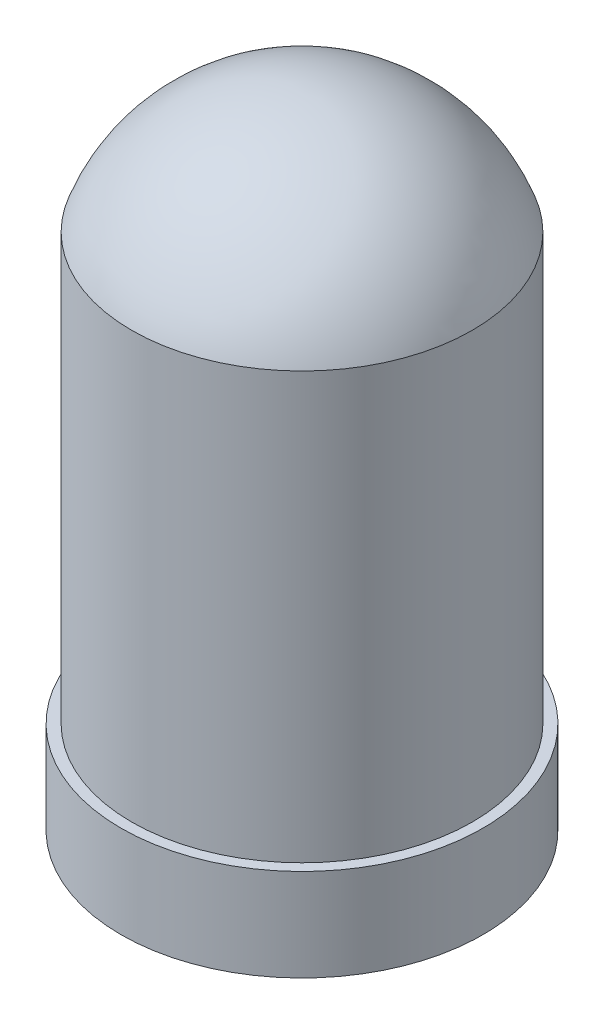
ISO-10303-21;
HEADER;
FILE_DESCRIPTION(('STEP AP214'),'2;1');
FILE_NAME('part.step','',(''),(''),'','','');
FILE_SCHEMA(('AUTOMOTIVE_DESIGN { 1 0 10303 214 1 1 1 1 }'));
ENDSEC;
DATA;
#1=APPLICATION_CONTEXT('core data for automotive mechanical design processes');
#2=APPLICATION_PROTOCOL_DEFINITION('international standard','automotive_design',2000,#1);
#3=PRODUCT_CONTEXT('',#1,'mechanical');
#4=PRODUCT('Part','Part','',(#3));
#5=PRODUCT_RELATED_PRODUCT_CATEGORY('part','',(#4));
#6=PRODUCT_DEFINITION_FORMATION('','',#4);
#7=PRODUCT_DEFINITION_CONTEXT('part definition',#1,'design');
#8=PRODUCT_DEFINITION('design','',#6,#7);
#9=PRODUCT_DEFINITION_SHAPE('','',#8);
#10=(LENGTH_UNIT() NAMED_UNIT(*) SI_UNIT(.MILLI.,.METRE.));
#11=(NAMED_UNIT(*) PLANE_ANGLE_UNIT() SI_UNIT($,.RADIAN.));
#12=(NAMED_UNIT(*) SI_UNIT($,.STERADIAN.) SOLID_ANGLE_UNIT());
#13=UNCERTAINTY_MEASURE_WITH_UNIT(LENGTH_MEASURE(1.E-05),#10,'distance_accuracy_value','');
#14=(GEOMETRIC_REPRESENTATION_CONTEXT(3) GLOBAL_UNCERTAINTY_ASSIGNED_CONTEXT((#13)) GLOBAL_UNIT_ASSIGNED_CONTEXT((#10,
#11,#12)) REPRESENTATION_CONTEXT('',''));
#15=CARTESIAN_POINT('',(0.,0.,0.));
#16=DIRECTION('',(0.,0.,1.));
#17=DIRECTION('',(1.,0.,0.));
#18=AXIS2_PLACEMENT_3D('',#15,#16,#17);
#19=CARTESIAN_POINT('',(0.,0.,0.));
#20=DIRECTION('',(0.,-1.,0.));
#21=DIRECTION('',(0.,0.,-1.));
#22=AXIS2_PLACEMENT_3D('',#19,#20,#21);
#23=CYLINDRICAL_SURFACE('',#22,2.4);
#24=CARTESIAN_POINT('',(0.,7.3,0.));
#25=DIRECTION('',(0.,-1.,0.));
#26=DIRECTION('',(0.,0.,-1.));
#27=AXIS2_PLACEMENT_3D('',#24,#25,#26);
#28=CIRCLE('',#27,2.4);
#29=CARTESIAN_POINT('',(0.,7.3,-2.4));
#30=VERTEX_POINT('',#29);
#31=EDGE_CURVE('E10',#30,#30,#28,.T.);
#32=ORIENTED_EDGE('',*,*,#31,.T.);
#33=EDGE_LOOP('',(#32));
#34=FACE_BOUND('',#33,.T.);
#35=CARTESIAN_POINT('',(0.,1.3,0.));
#36=DIRECTION('',(0.,-1.,0.));
#37=DIRECTION('',(0.,0.,-1.));
#38=AXIS2_PLACEMENT_3D('',#35,#36,#37);
#39=CIRCLE('',#38,2.4);
#40=CARTESIAN_POINT('',(0.,1.3,-2.4));
#41=VERTEX_POINT('',#40);
#42=EDGE_CURVE('E53',#41,#41,#39,.T.);
#43=ORIENTED_EDGE('',*,*,#42,.F.);
#44=EDGE_LOOP('',(#43));
#45=FACE_BOUND('',#44,.T.);
#46=ADVANCED_FACE('F39',(#34,#45),#23,.T.);
#47=CARTESIAN_POINT('',(0.,6.45588235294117,0.));
#48=DIRECTION('',(0.,-1.,0.));
#49=DIRECTION('',(1.,0.,0.));
#50=AXIS2_PLACEMENT_3D('',#47,#48,#49);
#51=SPHERICAL_SURFACE('',#50,2.54411764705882);
#52=ORIENTED_EDGE('',*,*,#31,.F.);
#53=EDGE_LOOP('',(#52));
#54=FACE_BOUND('',#53,.T.);
#55=ADVANCED_FACE('F63',(#54),#51,.T.);
#56=CARTESIAN_POINT('',(0.,0.,0.));
#57=DIRECTION('',(0.,-1.,0.));
#58=DIRECTION('',(0.,0.,-1.));
#59=AXIS2_PLACEMENT_3D('',#56,#57,#58);
#60=PLANE('',#59);
#61=CARTESIAN_POINT('',(0.,0.,0.));
#62=DIRECTION('',(0.,-1.,0.));
#63=DIRECTION('',(0.,0.,-1.));
#64=AXIS2_PLACEMENT_3D('',#61,#62,#63);
#65=CIRCLE('',#64,2.55);
#66=CARTESIAN_POINT('',(0.,0.,-2.55));
#67=VERTEX_POINT('',#66);
#68=EDGE_CURVE('E45',#67,#67,#65,.T.);
#69=ORIENTED_EDGE('',*,*,#68,.T.);
#70=EDGE_LOOP('',(#69));
#71=FACE_BOUND('',#70,.T.);
#72=ADVANCED_FACE('F67',(#71),#60,.T.);
#73=CARTESIAN_POINT('',(0.,0.,0.));
#74=DIRECTION('',(0.,-1.,0.));
#75=DIRECTION('',(0.,0.,-1.));
#76=AXIS2_PLACEMENT_3D('',#73,#74,#75);
#77=CYLINDRICAL_SURFACE('',#76,2.55);
#78=CARTESIAN_POINT('',(0.,1.3,0.));
#79=DIRECTION('',(0.,-1.,0.));
#80=DIRECTION('',(0.,0.,-1.));
#81=AXIS2_PLACEMENT_3D('',#78,#79,#80);
#82=CIRCLE('',#81,2.55);
#83=CARTESIAN_POINT('',(0.,1.3,-2.55));
#84=VERTEX_POINT('',#83);
#85=EDGE_CURVE('E49',#84,#84,#82,.T.);
#86=ORIENTED_EDGE('',*,*,#85,.T.);
#87=EDGE_LOOP('',(#86));
#88=FACE_BOUND('',#87,.T.);
#89=ORIENTED_EDGE('',*,*,#68,.F.);
#90=EDGE_LOOP('',(#89));
#91=FACE_BOUND('',#90,.T.);
#92=ADVANCED_FACE('F72',(#88,#91),#77,.T.);
#93=CARTESIAN_POINT('',(0.,1.3,0.));
#94=DIRECTION('',(0.,1.,0.));
#95=DIRECTION('',(0.,0.,1.));
#96=AXIS2_PLACEMENT_3D('',#93,#94,#95);
#97=PLANE('',#96);
#98=ORIENTED_EDGE('',*,*,#42,.T.);
#99=EDGE_LOOP('',(#98));
#100=FACE_BOUND('',#99,.T.);
#101=ORIENTED_EDGE('',*,*,#85,.F.);
#102=EDGE_LOOP('',(#101));
#103=FACE_BOUND('',#102,.T.);
#104=ADVANCED_FACE('F59',(#100,#103),#97,.T.);
#105=CLOSED_SHELL('',(#46,#55,#72,#92,#104));
#106=MANIFOLD_SOLID_BREP('B2',#105);
#107=ADVANCED_BREP_SHAPE_REPRESENTATION('',(#18,#106),#14);
#108=SHAPE_DEFINITION_REPRESENTATION(#9,#107);
ENDSEC;
END-ISO-10303-21;
